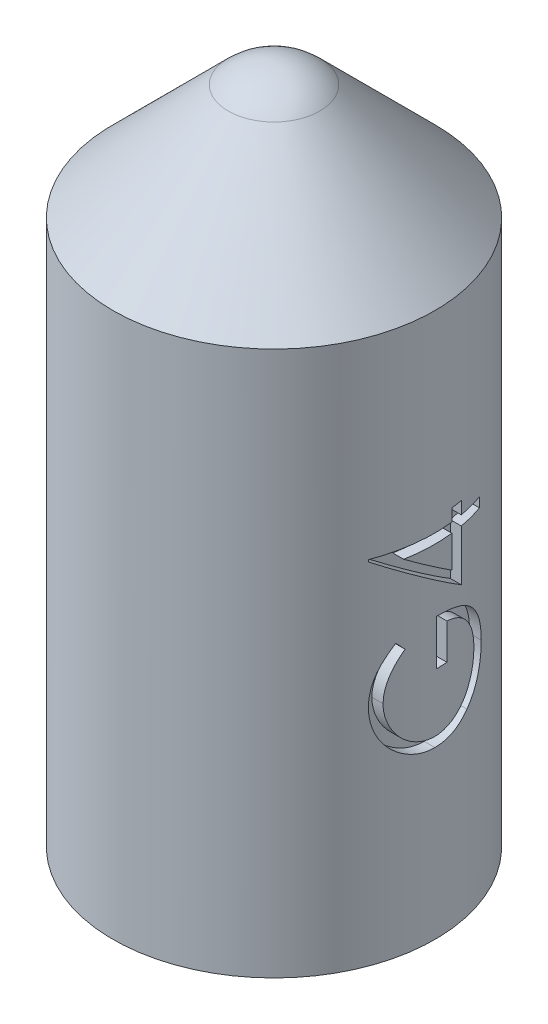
from build123d import *

# Parameters (mm, degrees)
ENL_V_MAT_EXTRU_1_REACH      = 9.314
ENL_V_MAT_EXTRU_1_END_RADIUS = 1.4
ENL_V_MAT_EXTRU_2_REACH      = 9.314
ENL_V_MAT_EXTRU_2_END_RADIUS = 1.4


with BuildPart() as part:
    # Esquisse1 → R_volution1 (revolve)
    with BuildSketch(Plane.XY):
        with BuildLine():
            Line((-1.5, 5.25), (-1.5, 0.17544468))
            ThreePointArc((-1.5, 0.17544468), (-0.755112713, 0.044010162), (0, 0))
            Line((0, 0), (0, 6.5))
            ThreePointArc((0, 6.5), (-0.230969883, 6.454057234), (-0.426776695, 6.323223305))
            Line((-0.426776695, 6.323223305), (-1.5, 5.25))
        make_face()
    revolve(axis=Axis((0, 0, 0), (0, 1, 0)))

    # Enl_v. mat.-Extru.1: up to this cylinder (the profile starts outside it)
    enl_v_mat_extru_1_end = Plane(origin=(0, 3.0544455, 0), z_dir=(0, -1, 0)) * Cylinder(ENL_V_MAT_EXTRU_1_END_RADIUS, 23.211165, mode=Mode.PRIVATE)
    # Esquisse2 → Enl_v. mat.-Extru.1 (cut, up to the surface)
    with BuildSketch(Plane(origin=(1.5, 0, 0), x_dir=(0, 0, -1), z_dir=(1, 0, 0)), mode=Mode.PRIVATE) as enl_v_mat_extru_1_sk1:
        Polygon((-0.525641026, 3.436913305), (-0.525641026, 3.455142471), (0.166666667, 3.455142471), (0.166666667, 3.570527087), (0.269230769, 3.570527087), (0.269230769, 3.455142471), (0.5, 3.455142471), (0.5, 3.365398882), (0.269230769, 3.365398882), (0.269230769, 2.891039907), align=None)
        Polygon((0.166666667, 3.365398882), (-0.267628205, 3.365398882), (0.166666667, 3.067321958), align=None, mode=Mode.SUBTRACT)
    enl_v_mat_extru_1_tool1 = extrude(enl_v_mat_extru_1_sk1.sketch, amount=-ENL_V_MAT_EXTRU_1_REACH, mode=Mode.PRIVATE) - enl_v_mat_extru_1_end
    add(enl_v_mat_extru_1_tool1.solids().sort_by_distance((1.5, 3.446028, 0.513338))[0], mode=Mode.SUBTRACT)
    # Esquisse2 → Enl_v. mat.-Extru.1 (cut, up to the surface)
    with BuildSketch(Plane(origin=(1.5, 0, 0), x_dir=(0, 0, -1), z_dir=(1, 0, 0)), mode=Mode.PRIVATE) as enl_v_mat_extru_1_sk2:
        with BuildLine():
            Line((-0.329326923, 2.711552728), (-0.256410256, 2.634629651))
            add(Edge.make_bspline(
                [(-0.256410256, 2.634629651), (-0.269509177, 2.620712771), (-0.295394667, 2.593210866), (-0.328926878, 2.548296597), (-0.357936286, 2.501623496), (-0.381363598, 2.453116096), (-0.399741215, 2.404046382), (-0.413100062, 2.35525811), (-0.421560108, 2.307067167), (-0.422576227, 2.275020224), (-0.423076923, 2.25922901)],
                knots=[0, 0, 0, 0, 1.089067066, 2.152164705, 3.18986567, 4.218445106, 5.218487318, 6.173592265, 7.100032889, 8, 8, 8, 8], degree=3))
            add(Edge.make_bspline(
                [(-0.423076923, 2.25922901), (-0.42295875, 2.249539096), (-0.42272271, 2.230184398), (-0.419710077, 2.201435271), (-0.415377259, 2.172987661), (-0.409108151, 2.144895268), (-0.401162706, 2.117103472), (-0.391224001, 2.089708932), (-0.379636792, 2.06266054), (-0.3662475, 2.036213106), (-0.351539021, 2.010572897), (-0.335239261, 1.986356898), (-0.317871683, 1.963409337), (-0.298997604, 1.942166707), (-0.278802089, 1.922487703), (-0.257648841, 1.90401036), (-0.235121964, 1.887079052), (-0.211314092, 1.87199744), (-0.186779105, 1.858378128), (-0.161725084, 1.846608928), (-0.136384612, 1.836377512), (-0.11056688, 1.828584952), (-0.084538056, 1.821984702), (-0.058161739, 1.817390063), (-0.031369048, 1.814791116), (-0.013426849, 1.814342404), (-0.004407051, 1.81411683)],
                knots=[0, 0, 0, 0, 1.028150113, 2.053633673, 3.06513288, 4.081487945, 5.106702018, 6.131327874, 7.172780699, 8.228344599, 9.276313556, 10.308389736, 11.324843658, 12.329040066, 13.321460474, 14.316307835, 15.308626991, 16.309440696, 17.305625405, 18.28535951, 19.246194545, 20.203493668, 21.145557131, 22.095268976, 23.042464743, 24, 24, 24, 24], degree=3))
            add(Edge.make_bspline(
                [(-0.004407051, 1.81411683), (0.004813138, 1.814332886), (0.023228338, 1.814764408), (0.050713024, 1.817522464), (0.077786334, 1.822652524), (0.104490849, 1.829455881), (0.130879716, 1.838105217), (0.156925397, 1.848731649), (0.18262536, 1.861390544), (0.207724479, 1.876010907), (0.232153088, 1.892156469), (0.255356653, 1.90991395), (0.277065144, 1.929313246), (0.297595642, 1.949998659), (0.316818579, 1.972158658), (0.334502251, 1.996008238), (0.350920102, 2.02121355), (0.365891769, 2.047785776), (0.379265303, 2.075444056), (0.391157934, 2.103803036), (0.400952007, 2.132953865), (0.408934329, 2.162743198), (0.415477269, 2.193135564), (0.41968655, 2.224285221), (0.422741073, 2.255963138), (0.422964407, 2.277317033), (0.423076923, 2.288075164)],
                knots=[0, 0, 0, 0, 0.935915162, 1.869274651, 2.799799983, 3.730201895, 4.664668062, 5.616159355, 6.583070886, 7.570012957, 8.562524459, 9.553461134, 10.53281078, 11.515274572, 12.509912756, 13.507571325, 14.526460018, 15.561318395, 16.601025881, 17.643204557, 18.680545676, 19.719612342, 20.772381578, 21.833430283, 22.908478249, 24, 24, 24, 24], degree=3))
            add(Edge.make_bspline(
                [(0.423076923, 2.288075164), (0.422806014, 2.301040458), (0.422274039, 2.326499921), (0.418129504, 2.36392387), (0.411664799, 2.399870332), (0.402167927, 2.434222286), (0.390147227, 2.467104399), (0.375281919, 2.498395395), (0.357728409, 2.528181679), (0.337842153, 2.556334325), (0.315685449, 2.582184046), (0.291989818, 2.605710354), (0.266448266, 2.626104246), (0.239441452, 2.643974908), (0.21071105, 2.658745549), (0.180416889, 2.670872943), (0.148540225, 2.68016793), (0.126514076, 2.68398367), (0.115384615, 2.685911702)],
                knots=[0, 0, 0, 0, 1.130199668, 2.219330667, 3.279027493, 4.311506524, 5.322739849, 6.327972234, 7.327472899, 8.33386792, 9.329086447, 10.29244429, 11.240784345, 12.174119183, 13.111530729, 14.052100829, 15.015757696, 16, 16, 16, 16], degree=3))
            Line((0.115384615, 2.685911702), (0.115384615, 2.352578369))
            Line((0.115384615, 2.352578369), (0.012820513, 2.352578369))
            Line((0.012820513, 2.352578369), (0.012820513, 2.775655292))
            add(Edge.make_bspline(
                [(0.012820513, 2.775655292), (0.031936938, 2.775167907), (0.069351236, 2.774214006), (0.12391417, 2.767522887), (0.17544894, 2.756718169), (0.224009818, 2.74195808), (0.269527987, 2.722850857), (0.312049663, 2.699601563), (0.351300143, 2.6718381), (0.387599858, 2.640549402), (0.419979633, 2.605435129), (0.448438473, 2.567444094), (0.472410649, 2.526513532), (0.491913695, 2.482682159), (0.507134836, 2.436093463), (0.517926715, 2.38663964), (0.524392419, 2.334387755), (0.525218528, 2.298577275), (0.525641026, 2.280262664)],
                knots=[0, 0, 0, 0, 1.140356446, 2.231883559, 3.274166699, 4.278491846, 5.25512956, 6.21435461, 7.1637429, 8.11826594, 9.068280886, 10.0076534, 10.945064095, 11.891975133, 12.864533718, 13.863980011, 14.907571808, 16, 16, 16, 16], degree=3))
            add(Edge.make_bspline(
                [(0.525641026, 2.280262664), (0.52547842, 2.268974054), (0.525157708, 2.246709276), (0.522878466, 2.213826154), (0.51936973, 2.181849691), (0.514071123, 2.150784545), (0.507581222, 2.120516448), (0.499270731, 2.091196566), (0.489651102, 2.062713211), (0.478709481, 2.035022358), (0.466031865, 2.008375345), (0.451943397, 1.982653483), (0.436516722, 1.95771459), (0.419485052, 1.933728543), (0.400975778, 1.910570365), (0.380951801, 1.888389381), (0.359474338, 1.867061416), (0.344223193, 1.853701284), (0.336538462, 1.846969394)],
                knots=[0, 0, 0, 0, 1.107784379, 2.184907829, 3.233506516, 4.263428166, 5.276301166, 6.270063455, 7.25232949, 8.225834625, 9.190232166, 10.146266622, 11.1027726, 12.066435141, 13.031522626, 14.010570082, 14.99756817, 16, 16, 16, 16], degree=3))
            add(Edge.make_bspline(
                [(0.336538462, 1.846969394), (0.324346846, 1.837201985), (0.300165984, 1.817829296), (0.261423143, 1.79289268), (0.221308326, 1.771635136), (0.179709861, 1.754387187), (0.136666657, 1.740919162), (0.092233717, 1.731260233), (0.046353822, 1.725601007), (0.015306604, 1.724785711), (-0.000400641, 1.724373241)],
                knots=[0, 0, 0, 0, 1.023165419, 2.029347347, 3.013907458, 3.994755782, 4.975994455, 5.96558838, 6.970761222, 8, 8, 8, 8], degree=3))
            add(Edge.make_bspline(
                [(-0.000400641, 1.724373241), (-0.012162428, 1.724525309), (-0.035536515, 1.724827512), (-0.070238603, 1.728491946), (-0.104324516, 1.733749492), (-0.137766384, 1.741477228), (-0.170586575, 1.751218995), (-0.202800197, 1.763377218), (-0.234426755, 1.777532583), (-0.265246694, 1.793986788), (-0.294858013, 1.812292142), (-0.323115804, 1.832180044), (-0.349562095, 1.853803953), (-0.374258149, 1.877226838), (-0.397569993, 1.901976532), (-0.419010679, 1.928572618), (-0.438915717, 1.956612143), (-0.456902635, 1.986312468), (-0.473064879, 2.017204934), (-0.487232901, 2.049222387), (-0.498942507, 2.082353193), (-0.508877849, 2.116349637), (-0.516225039, 2.151468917), (-0.52155325, 2.187456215), (-0.525199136, 2.224499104), (-0.525492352, 2.249537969), (-0.525641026, 2.262233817)],
                knots=[0, 0, 0, 0, 1.00895651, 2.005089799, 2.991467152, 3.967318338, 4.948153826, 5.927364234, 6.919980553, 7.91976625, 8.923240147, 9.905815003, 10.88314567, 11.851989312, 12.825009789, 13.798721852, 14.781296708, 15.773896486, 16.776076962, 17.771600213, 18.775744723, 19.78957137, 20.808953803, 21.851964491, 22.910847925, 24, 24, 24, 24], degree=3))
            add(Edge.make_bspline(
                [(-0.525641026, 2.262233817), (-0.525475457, 2.272587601), (-0.525147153, 2.293117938), (-0.522871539, 2.323668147), (-0.519264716, 2.353746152), (-0.514342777, 2.383396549), (-0.507638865, 2.412518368), (-0.499616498, 2.441194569), (-0.490275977, 2.469466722), (-0.479136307, 2.497246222), (-0.466492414, 2.524719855), (-0.452260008, 2.552040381), (-0.436195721, 2.579114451), (-0.418251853, 2.605989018), (-0.398736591, 2.632833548), (-0.377091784, 2.659223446), (-0.354170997, 2.685795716), (-0.337690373, 2.702881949), (-0.329326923, 2.711552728)],
                knots=[0, 0, 0, 0, 0.985871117, 1.954866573, 2.915460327, 3.869826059, 4.81536089, 5.759505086, 6.70452669, 7.649098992, 8.607881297, 9.583363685, 10.581137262, 11.603961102, 12.659522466, 13.73993555, 14.853081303, 16, 16, 16, 16], degree=3))
        make_face()
    enl_v_mat_extru_1_tool2 = extrude(enl_v_mat_extru_1_sk2.sketch, amount=-ENL_V_MAT_EXTRU_1_REACH, mode=Mode.PRIVATE) - enl_v_mat_extru_1_end
    add(enl_v_mat_extru_1_tool2.solids().sort_by_distance((1.5, 2.662863, 0.303659))[0], mode=Mode.SUBTRACT)

    # Enl_v. mat.-Extru.2: up to this cylinder (the profile starts outside it)
    enl_v_mat_extru_2_end = Plane(origin=(0, 3.0448155, 0), z_dir=(0, -1, 0)) * Cylinder(ENL_V_MAT_EXTRU_2_END_RADIUS, 23.211165, mode=Mode.PRIVATE)
    # Esquisse3 → Enl_v. mat.-Extru.2 (cut, up to the surface)
    with BuildSketch(Plane.ZY.offset(1.5), mode=Mode.PRIVATE) as enl_v_mat_extru_2_sk1:
        Polygon((-0.525641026, 3.427283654), (-0.525641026, 3.445512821), (0.166666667, 3.445512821), (0.166666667, 3.560897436), (0.269230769, 3.560897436), (0.269230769, 3.445512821), (0.5, 3.445512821), (0.5, 3.355769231), (0.269230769, 3.355769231), (0.269230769, 2.881410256), align=None)
        Polygon((0.166666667, 3.355769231), (-0.267628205, 3.355769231), (0.166666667, 3.057692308), align=None, mode=Mode.SUBTRACT)
    enl_v_mat_extru_2_tool1 = extrude(enl_v_mat_extru_2_sk1.sketch, amount=-ENL_V_MAT_EXTRU_2_REACH, mode=Mode.PRIVATE) - enl_v_mat_extru_2_end
    add(enl_v_mat_extru_2_tool1.solids().sort_by_distance((-1.5, 3.436398, -0.513338))[0], mode=Mode.SUBTRACT)
    # Esquisse3 → Enl_v. mat.-Extru.2 (cut, up to the surface)
    with BuildSketch(Plane.ZY.offset(1.5), mode=Mode.PRIVATE) as enl_v_mat_extru_2_sk2:
        with BuildLine():
            Line((-0.329326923, 2.701923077), (-0.256410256, 2.625))
            add(Edge.make_bspline(
                [(-0.256410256, 2.625), (-0.269509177, 2.61108312), (-0.295394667, 2.583581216), (-0.328926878, 2.538666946), (-0.357936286, 2.491993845), (-0.381363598, 2.443486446), (-0.399741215, 2.394416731), (-0.413100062, 2.345628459), (-0.421560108, 2.297437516), (-0.422576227, 2.265390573), (-0.423076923, 2.249599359)],
                knots=[0, 0, 0, 0, 1.089067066, 2.152164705, 3.18986567, 4.218445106, 5.218487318, 6.173592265, 7.100032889, 8, 8, 8, 8], degree=3))
            add(Edge.make_bspline(
                [(-0.423076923, 2.249599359), (-0.42295875, 2.239909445), (-0.42272271, 2.220554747), (-0.419710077, 2.191805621), (-0.415377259, 2.16335801), (-0.409108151, 2.135265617), (-0.401162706, 2.107473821), (-0.391224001, 2.080079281), (-0.379636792, 2.05303089), (-0.3662475, 2.026583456), (-0.351539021, 2.000943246), (-0.335239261, 1.976727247), (-0.317871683, 1.953779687), (-0.298997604, 1.932537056), (-0.278802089, 1.912858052), (-0.257648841, 1.894380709), (-0.235121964, 1.877449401), (-0.211314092, 1.86236779), (-0.186779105, 1.848748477), (-0.161725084, 1.836979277), (-0.136384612, 1.826747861), (-0.11056688, 1.818955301), (-0.084538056, 1.812355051), (-0.058161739, 1.807760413), (-0.031369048, 1.805161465), (-0.013426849, 1.804712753), (-0.004407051, 1.804487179)],
                knots=[0, 0, 0, 0, 1.028150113, 2.053633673, 3.06513288, 4.081487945, 5.106702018, 6.131327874, 7.172780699, 8.228344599, 9.276313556, 10.308389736, 11.324843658, 12.329040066, 13.321460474, 14.316307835, 15.308626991, 16.309440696, 17.305625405, 18.28535951, 19.246194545, 20.203493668, 21.145557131, 22.095268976, 23.042464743, 24, 24, 24, 24], degree=3))
            add(Edge.make_bspline(
                [(-0.004407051, 1.804487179), (0.004813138, 1.804703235), (0.023228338, 1.805134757), (0.050713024, 1.807892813), (0.077786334, 1.813022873), (0.104490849, 1.81982623), (0.130879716, 1.828475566), (0.156925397, 1.839101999), (0.18262536, 1.851760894), (0.207724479, 1.866381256), (0.232153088, 1.882526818), (0.255356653, 1.9002843), (0.277065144, 1.919683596), (0.297595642, 1.940369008), (0.316818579, 1.962529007), (0.334502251, 1.986378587), (0.350920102, 2.0115839), (0.365891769, 2.038156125), (0.379265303, 2.065814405), (0.391157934, 2.094173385), (0.400952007, 2.123324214), (0.408934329, 2.153113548), (0.415477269, 2.183505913), (0.41968655, 2.21465557), (0.422741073, 2.246333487), (0.422964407, 2.267687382), (0.423076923, 2.278445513)],
                knots=[0, 0, 0, 0, 0.935915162, 1.869274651, 2.799799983, 3.730201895, 4.664668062, 5.616159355, 6.583070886, 7.570012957, 8.562524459, 9.553461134, 10.53281078, 11.515274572, 12.509912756, 13.507571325, 14.526460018, 15.561318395, 16.601025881, 17.643204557, 18.680545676, 19.719612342, 20.772381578, 21.833430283, 22.908478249, 24, 24, 24, 24], degree=3))
            add(Edge.make_bspline(
                [(0.423076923, 2.278445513), (0.422806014, 2.291410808), (0.422274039, 2.316870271), (0.418129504, 2.354294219), (0.411664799, 2.390240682), (0.402167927, 2.424592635), (0.390147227, 2.457474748), (0.375281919, 2.488765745), (0.357728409, 2.518552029), (0.337842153, 2.546704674), (0.315685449, 2.572554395), (0.291989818, 2.596080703), (0.266448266, 2.616474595), (0.239441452, 2.634345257), (0.21071105, 2.649115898), (0.180416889, 2.661243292), (0.148540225, 2.670538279), (0.126514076, 2.674354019), (0.115384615, 2.676282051)],
                knots=[0, 0, 0, 0, 1.130199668, 2.219330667, 3.279027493, 4.311506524, 5.322739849, 6.327972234, 7.327472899, 8.33386792, 9.329086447, 10.29244429, 11.240784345, 12.174119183, 13.111530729, 14.052100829, 15.015757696, 16, 16, 16, 16], degree=3))
            Line((0.115384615, 2.676282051), (0.115384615, 2.342948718))
            Line((0.115384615, 2.342948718), (0.012820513, 2.342948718))
            Line((0.012820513, 2.342948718), (0.012820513, 2.766025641))
            add(Edge.make_bspline(
                [(0.012820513, 2.766025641), (0.031936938, 2.765538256), (0.069351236, 2.764584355), (0.12391417, 2.757893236), (0.17544894, 2.747088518), (0.224009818, 2.732328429), (0.269527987, 2.713221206), (0.312049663, 2.689971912), (0.351300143, 2.662208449), (0.387599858, 2.630919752), (0.419979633, 2.595805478), (0.448438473, 2.557814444), (0.472410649, 2.516883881), (0.491913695, 2.473052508), (0.507134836, 2.426463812), (0.517926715, 2.37700999), (0.524392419, 2.324758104), (0.525218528, 2.288947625), (0.525641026, 2.270633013)],
                knots=[0, 0, 0, 0, 1.140356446, 2.231883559, 3.274166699, 4.278491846, 5.25512956, 6.21435461, 7.1637429, 8.11826594, 9.068280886, 10.0076534, 10.945064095, 11.891975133, 12.864533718, 13.863980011, 14.907571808, 16, 16, 16, 16], degree=3))
            add(Edge.make_bspline(
                [(0.525641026, 2.270633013), (0.52547842, 2.259344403), (0.525157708, 2.237079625), (0.522878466, 2.204196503), (0.51936973, 2.17222004), (0.514071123, 2.141154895), (0.507581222, 2.110886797), (0.499270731, 2.081566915), (0.489651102, 2.053083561), (0.478709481, 2.025392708), (0.466031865, 1.998745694), (0.451943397, 1.973023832), (0.436516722, 1.948084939), (0.419485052, 1.924098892), (0.400975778, 1.900940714), (0.380951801, 1.878759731), (0.359474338, 1.857431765), (0.344223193, 1.844071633), (0.336538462, 1.837339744)],
                knots=[0, 0, 0, 0, 1.107784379, 2.184907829, 3.233506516, 4.263428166, 5.276301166, 6.270063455, 7.25232949, 8.225834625, 9.190232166, 10.146266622, 11.1027726, 12.066435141, 13.031522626, 14.010570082, 14.99756817, 16, 16, 16, 16], degree=3))
            add(Edge.make_bspline(
                [(0.336538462, 1.837339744), (0.324346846, 1.827572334), (0.300165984, 1.808199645), (0.261423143, 1.783263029), (0.221308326, 1.762005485), (0.179709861, 1.744757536), (0.136666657, 1.731289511), (0.092233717, 1.721630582), (0.046353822, 1.715971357), (0.015306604, 1.71515606), (-0.000400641, 1.71474359)],
                knots=[0, 0, 0, 0, 1.023165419, 2.029347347, 3.013907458, 3.994755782, 4.975994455, 5.96558838, 6.970761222, 8, 8, 8, 8], degree=3))
            add(Edge.make_bspline(
                [(-0.000400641, 1.71474359), (-0.012162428, 1.714895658), (-0.035536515, 1.715197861), (-0.070238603, 1.718862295), (-0.104324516, 1.724119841), (-0.137766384, 1.731847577), (-0.170586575, 1.741589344), (-0.202800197, 1.753747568), (-0.234426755, 1.767902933), (-0.265246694, 1.784357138), (-0.294858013, 1.802662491), (-0.323115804, 1.822550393), (-0.349562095, 1.844174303), (-0.374258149, 1.867597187), (-0.397569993, 1.892346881), (-0.419010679, 1.918942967), (-0.438915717, 1.946982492), (-0.456902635, 1.976682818), (-0.473064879, 2.007575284), (-0.487232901, 2.039592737), (-0.498942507, 2.072723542), (-0.508877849, 2.106719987), (-0.516225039, 2.141839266), (-0.52155325, 2.177826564), (-0.525199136, 2.214869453), (-0.525492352, 2.239908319), (-0.525641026, 2.252604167)],
                knots=[0, 0, 0, 0, 1.00895651, 2.005089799, 2.991467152, 3.967318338, 4.948153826, 5.927364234, 6.919980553, 7.91976625, 8.923240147, 9.905815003, 10.88314567, 11.851989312, 12.825009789, 13.798721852, 14.781296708, 15.773896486, 16.776076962, 17.771600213, 18.775744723, 19.78957137, 20.808953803, 21.851964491, 22.910847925, 24, 24, 24, 24], degree=3))
            add(Edge.make_bspline(
                [(-0.525641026, 2.252604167), (-0.525475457, 2.262957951), (-0.525147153, 2.283488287), (-0.522871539, 2.314038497), (-0.519264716, 2.344116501), (-0.514342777, 2.373766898), (-0.507638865, 2.402888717), (-0.499616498, 2.431564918), (-0.490275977, 2.459837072), (-0.479136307, 2.487616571), (-0.466492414, 2.515090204), (-0.452260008, 2.54241073), (-0.436195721, 2.569484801), (-0.418251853, 2.596359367), (-0.398736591, 2.623203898), (-0.377091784, 2.649593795), (-0.354170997, 2.676166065), (-0.337690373, 2.693252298), (-0.329326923, 2.701923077)],
                knots=[0, 0, 0, 0, 0.985871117, 1.954866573, 2.915460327, 3.869826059, 4.81536089, 5.759505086, 6.70452669, 7.649098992, 8.607881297, 9.583363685, 10.581137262, 11.603961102, 12.659522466, 13.73993555, 14.853081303, 16, 16, 16, 16], degree=3))
        make_face()
    enl_v_mat_extru_2_tool2 = extrude(enl_v_mat_extru_2_sk2.sketch, amount=-ENL_V_MAT_EXTRU_2_REACH, mode=Mode.PRIVATE) - enl_v_mat_extru_2_end
    add(enl_v_mat_extru_2_tool2.solids().sort_by_distance((-1.5, 2.653233, -0.303659))[0], mode=Mode.SUBTRACT)


solid = part.part
